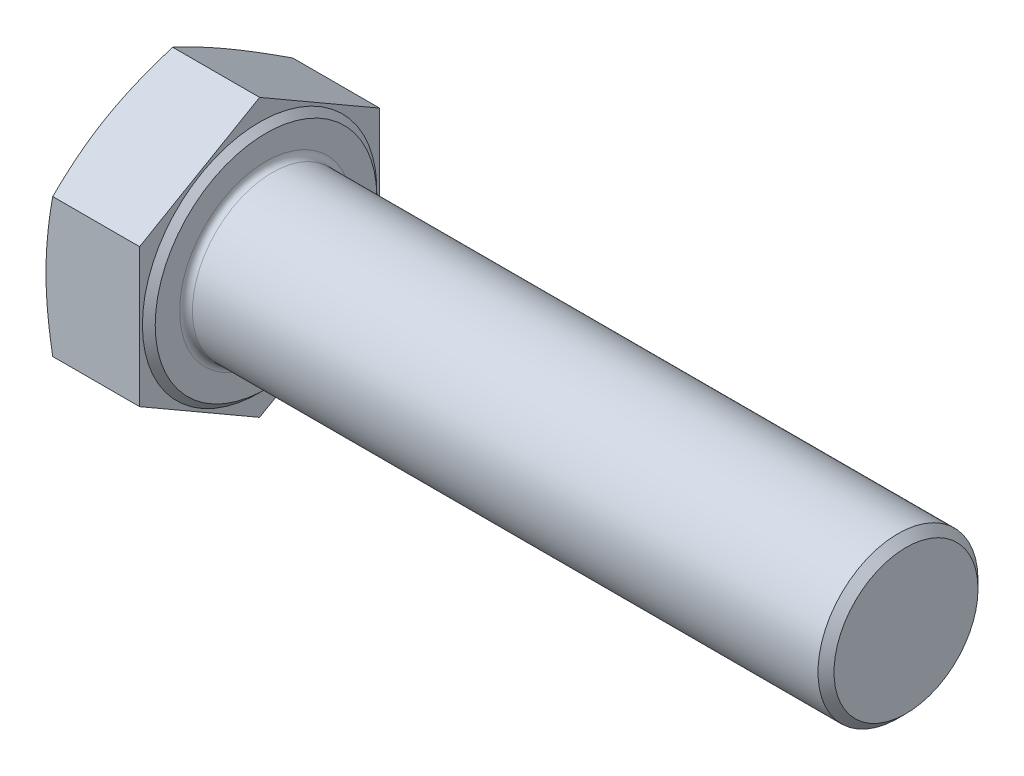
from build123d import *

# Parameters (mm, degrees)
BASEHEAD_DEPTH = 12.5
SKETCH5_R      = 10
BASEBODY_DEPTH = 80
CHAMFER1_SIZE  = 1
HEADFILLET_R   = 0.8


with BuildPart() as part:
    # Sketch2 → BaseHead (new body)
    with BuildSketch(Plane(origin=(0, 0, 0), x_dir=(0, 0, -1), z_dir=(1, 0, 0))):
        Polygon((0, -17.320508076), (15, -8.660254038), (15, 8.660254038), (0, 17.320508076), (-15, 8.660254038), (-15, -8.660254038), align=None)
    extrude(amount=BASEHEAD_DEPTH)

    # Sketch3 → BearingFace (revolve, cut)
    with BuildSketch(Plane.XY, mode=Mode.PRIVATE) as bearingface_sk:
        Polygon((12.5, 17.320508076), (12.5, 13.85), (11.7, 14.65), (11.7, 17.320508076), align=None)
    revolve(bearingface_sk.sketch.rotate(Axis((-0.957090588, 0, 0), (1, 0, 0)), 90), axis=Axis((-0.957090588, 0, 0), (1, 0, 0)), mode=Mode.SUBTRACT)

    # Sketch4 → HeadChamfer (revolve, cut)
    with BuildSketch(Plane.XY):
        Polygon((0, 17.320508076), (0.844595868, 17.320508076), (0, 15), align=None)
    revolve(axis=Axis((-0.493528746, 0, 0), (1, 0, 0)), mode=Mode.SUBTRACT)

    # Sketch5 → BaseBody (add)
    with BuildSketch(Plane(origin=(12.5, 0, 0), x_dir=(0, 0, -1), z_dir=(1, 0, 0))):
        Circle(SKETCH5_R)
    extrude(amount=BASEBODY_DEPTH)

    # Chamfer1
    chamfer1_edges = [part.edges().sort_by_distance(p)[0] for p in [
        (92.5, 0, 10),
    ]]
    chamfer(chamfer1_edges, length=CHAMFER1_SIZE)

    # HeadFillet
    headfillet_edges = [part.edges().sort_by_distance(p)[0] for p in [
        (12.5, 0, 10),
    ]]
    fillet(headfillet_edges, radius=HEADFILLET_R)


solid = part.part
